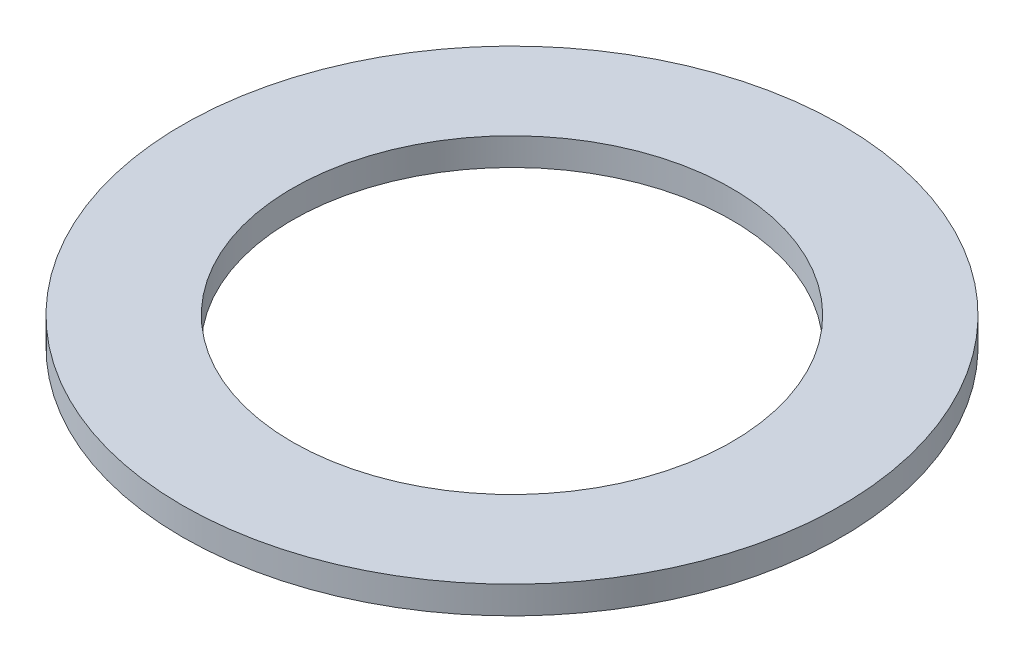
ISO-10303-21;
HEADER;
FILE_DESCRIPTION(('STEP AP214'),'2;1');
FILE_NAME('part.step','',(''),(''),'','','');
FILE_SCHEMA(('AUTOMOTIVE_DESIGN { 1 0 10303 214 1 1 1 1 }'));
ENDSEC;
DATA;
#1=APPLICATION_CONTEXT('core data for automotive mechanical design processes');
#2=APPLICATION_PROTOCOL_DEFINITION('international standard','automotive_design',2000,#1);
#3=PRODUCT_CONTEXT('',#1,'mechanical');
#4=PRODUCT('Part','Part','',(#3));
#5=PRODUCT_RELATED_PRODUCT_CATEGORY('part','',(#4));
#6=PRODUCT_DEFINITION_FORMATION('','',#4);
#7=PRODUCT_DEFINITION_CONTEXT('part definition',#1,'design');
#8=PRODUCT_DEFINITION('design','',#6,#7);
#9=PRODUCT_DEFINITION_SHAPE('','',#8);
#10=(LENGTH_UNIT() NAMED_UNIT(*) SI_UNIT(.MILLI.,.METRE.));
#11=(NAMED_UNIT(*) PLANE_ANGLE_UNIT() SI_UNIT($,.RADIAN.));
#12=(NAMED_UNIT(*) SI_UNIT($,.STERADIAN.) SOLID_ANGLE_UNIT());
#13=UNCERTAINTY_MEASURE_WITH_UNIT(LENGTH_MEASURE(1.E-05),#10,'distance_accuracy_value','');
#14=(GEOMETRIC_REPRESENTATION_CONTEXT(3) GLOBAL_UNCERTAINTY_ASSIGNED_CONTEXT((#13)) GLOBAL_UNIT_ASSIGNED_CONTEXT((#10,
#11,#12)) REPRESENTATION_CONTEXT('',''));
#15=CARTESIAN_POINT('',(0.,0.,0.));
#16=DIRECTION('',(0.,0.,1.));
#17=DIRECTION('',(1.,0.,0.));
#18=AXIS2_PLACEMENT_3D('',#15,#16,#17);
#19=CARTESIAN_POINT('',(0.,3.175,0.));
#20=DIRECTION('',(0.,1.,0.));
#21=DIRECTION('',(0.,0.,1.));
#22=AXIS2_PLACEMENT_3D('',#19,#20,#21);
#23=PLANE('',#22);
#24=CARTESIAN_POINT('',(0.,3.175,0.));
#25=DIRECTION('',(0.,1.,0.));
#26=DIRECTION('',(0.,0.,1.));
#27=AXIS2_PLACEMENT_3D('',#24,#25,#26);
#28=CIRCLE('',#27,38.1);
#29=CARTESIAN_POINT('',(0.,3.175,38.1));
#30=VERTEX_POINT('',#29);
#31=EDGE_CURVE('E10',#30,#30,#28,.T.);
#32=ORIENTED_EDGE('',*,*,#31,.T.);
#33=EDGE_LOOP('',(#32));
#34=FACE_BOUND('',#33,.T.);
#35=CARTESIAN_POINT('',(0.,3.175,0.));
#36=DIRECTION('',(0.,1.,0.));
#37=DIRECTION('',(0.,0.,1.));
#38=AXIS2_PLACEMENT_3D('',#35,#36,#37);
#39=CIRCLE('',#38,25.4);
#40=CARTESIAN_POINT('',(0.,3.175,25.4));
#41=VERTEX_POINT('',#40);
#42=EDGE_CURVE('E42',#41,#41,#39,.T.);
#43=ORIENTED_EDGE('',*,*,#42,.F.);
#44=EDGE_LOOP('',(#43));
#45=FACE_BOUND('',#44,.T.);
#46=ADVANCED_FACE('F31',(#34,#45),#23,.T.);
#47=CARTESIAN_POINT('',(0.,0.,0.));
#48=DIRECTION('',(0.,1.,0.));
#49=DIRECTION('',(0.,0.,1.));
#50=AXIS2_PLACEMENT_3D('',#47,#48,#49);
#51=PLANE('',#50);
#52=CARTESIAN_POINT('',(0.,0.,0.));
#53=DIRECTION('',(0.,1.,0.));
#54=DIRECTION('',(0.,0.,1.));
#55=AXIS2_PLACEMENT_3D('',#52,#53,#54);
#56=CIRCLE('',#55,38.1);
#57=CARTESIAN_POINT('',(0.,0.,38.1));
#58=VERTEX_POINT('',#57);
#59=EDGE_CURVE('E35',#58,#58,#56,.T.);
#60=ORIENTED_EDGE('',*,*,#59,.F.);
#61=EDGE_LOOP('',(#60));
#62=FACE_BOUND('',#61,.T.);
#63=CARTESIAN_POINT('',(0.,0.,0.));
#64=DIRECTION('',(0.,1.,0.));
#65=DIRECTION('',(0.,0.,1.));
#66=AXIS2_PLACEMENT_3D('',#63,#64,#65);
#67=CIRCLE('',#66,25.4);
#68=CARTESIAN_POINT('',(0.,0.,25.4));
#69=VERTEX_POINT('',#68);
#70=EDGE_CURVE('E44',#69,#69,#67,.T.);
#71=ORIENTED_EDGE('',*,*,#70,.T.);
#72=EDGE_LOOP('',(#71));
#73=FACE_BOUND('',#72,.T.);
#74=ADVANCED_FACE('F54',(#62,#73),#51,.F.);
#75=CARTESIAN_POINT('',(0.,3.175,0.));
#76=DIRECTION('',(0.,-1.,0.));
#77=DIRECTION('',(0.,0.,-1.));
#78=AXIS2_PLACEMENT_3D('',#75,#76,#77);
#79=CYLINDRICAL_SURFACE('',#78,38.1);
#80=ORIENTED_EDGE('',*,*,#31,.F.);
#81=EDGE_LOOP('',(#80));
#82=FACE_BOUND('',#81,.T.);
#83=ORIENTED_EDGE('',*,*,#59,.T.);
#84=EDGE_LOOP('',(#83));
#85=FACE_BOUND('',#84,.T.);
#86=ADVANCED_FACE('F33',(#82,#85),#79,.T.);
#87=CARTESIAN_POINT('',(0.,3.175,0.));
#88=DIRECTION('',(0.,-1.,0.));
#89=DIRECTION('',(0.,0.,-1.));
#90=AXIS2_PLACEMENT_3D('',#87,#88,#89);
#91=CYLINDRICAL_SURFACE('',#90,25.4);
#92=ORIENTED_EDGE('',*,*,#42,.T.);
#93=EDGE_LOOP('',(#92));
#94=FACE_BOUND('',#93,.T.);
#95=ORIENTED_EDGE('',*,*,#70,.F.);
#96=EDGE_LOOP('',(#95));
#97=FACE_BOUND('',#96,.T.);
#98=ADVANCED_FACE('F50',(#94,#97),#91,.F.);
#99=CLOSED_SHELL('',(#46,#74,#86,#98));
#100=MANIFOLD_SOLID_BREP('B2',#99);
#101=ADVANCED_BREP_SHAPE_REPRESENTATION('',(#18,#100),#14);
#102=SHAPE_DEFINITION_REPRESENTATION(#9,#101);
ENDSEC;
END-ISO-10303-21;
